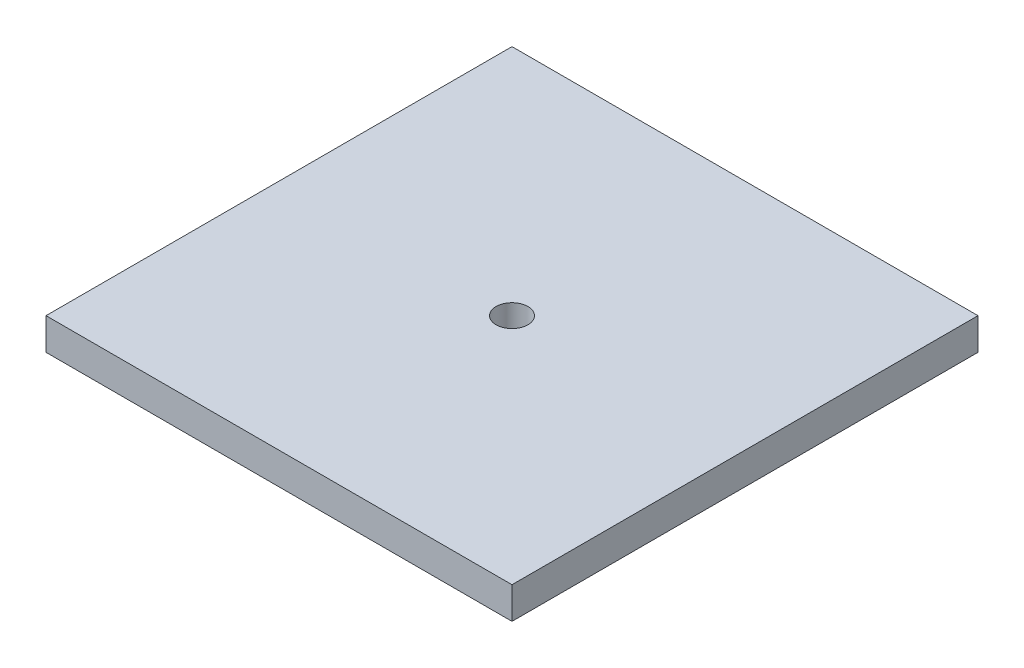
from build123d import *

# Parameters (mm, degrees)
ESQUISSE1_W      = 88
ESQUISSE1_H      = 88
ESQUISSE1_R      = 3
EXTRUSION1_DEPTH = 6


with BuildPart() as part:
    # Esquisse1 → Extrusion1 (new body)
    with BuildSketch(Plane(origin=(0, 0, 0), x_dir=(1, 0, 0), z_dir=(0, 1, 0))):
        with Locations((44, 44)):
            Rectangle(ESQUISSE1_W, ESQUISSE1_H)
        with Locations(Location((44, 44, 0), (0, 0, 270))):
            Circle(ESQUISSE1_R, mode=Mode.SUBTRACT)
    extrude(amount=EXTRUSION1_DEPTH)


solid = part.part
